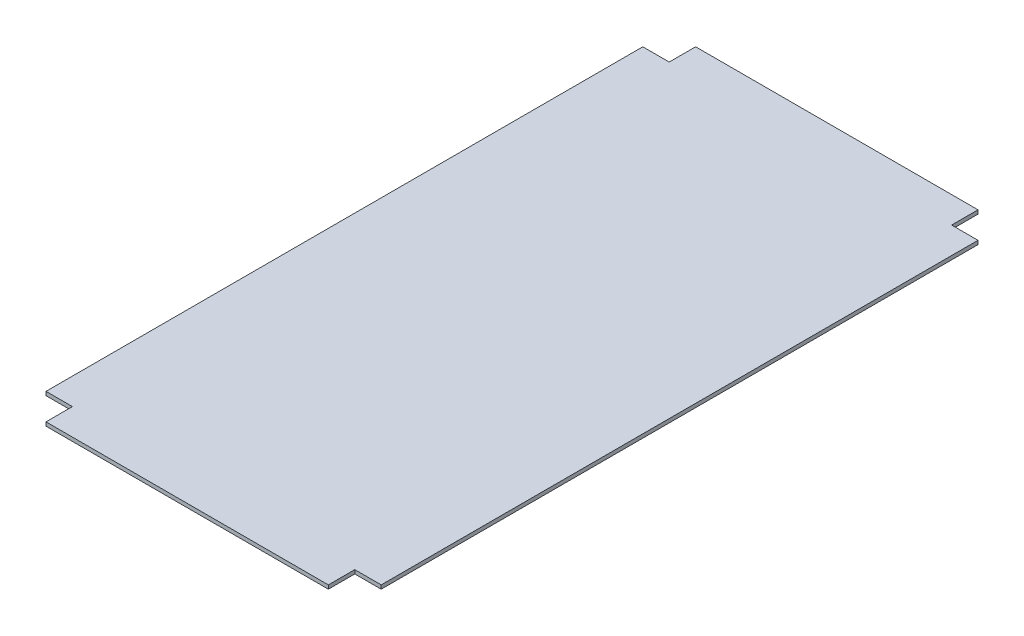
ISO-10303-21;
HEADER;
FILE_DESCRIPTION(('STEP AP214'),'2;1');
FILE_NAME('part.step','',(''),(''),'','','');
FILE_SCHEMA(('AUTOMOTIVE_DESIGN { 1 0 10303 214 1 1 1 1 }'));
ENDSEC;
DATA;
#1=APPLICATION_CONTEXT('core data for automotive mechanical design processes');
#2=APPLICATION_PROTOCOL_DEFINITION('international standard','automotive_design',2000,#1);
#3=PRODUCT_CONTEXT('',#1,'mechanical');
#4=PRODUCT('Part','Part','',(#3));
#5=PRODUCT_RELATED_PRODUCT_CATEGORY('part','',(#4));
#6=PRODUCT_DEFINITION_FORMATION('','',#4);
#7=PRODUCT_DEFINITION_CONTEXT('part definition',#1,'design');
#8=PRODUCT_DEFINITION('design','',#6,#7);
#9=PRODUCT_DEFINITION_SHAPE('','',#8);
#10=(LENGTH_UNIT() NAMED_UNIT(*) SI_UNIT(.MILLI.,.METRE.));
#11=(NAMED_UNIT(*) PLANE_ANGLE_UNIT() SI_UNIT($,.RADIAN.));
#12=(NAMED_UNIT(*) SI_UNIT($,.STERADIAN.) SOLID_ANGLE_UNIT());
#13=UNCERTAINTY_MEASURE_WITH_UNIT(LENGTH_MEASURE(1.E-05),#10,'distance_accuracy_value','');
#14=(GEOMETRIC_REPRESENTATION_CONTEXT(3) GLOBAL_UNCERTAINTY_ASSIGNED_CONTEXT((#13)) GLOBAL_UNIT_ASSIGNED_CONTEXT((#10,
#11,#12)) REPRESENTATION_CONTEXT('',''));
#15=CARTESIAN_POINT('',(0.,0.,0.));
#16=DIRECTION('',(0.,0.,1.));
#17=DIRECTION('',(1.,0.,0.));
#18=AXIS2_PLACEMENT_3D('',#15,#16,#17);
#19=CARTESIAN_POINT('',(-266.5,2.99999999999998,516.5));
#20=DIRECTION('',(1.,0.,0.));
#21=DIRECTION('',(0.,0.,-1.));
#22=AXIS2_PLACEMENT_3D('',#19,#20,#21);
#23=PLANE('',#22);
#24=DIRECTION('',(0.,0.,-1.));
#25=VECTOR('',#24,1.);
#26=CARTESIAN_POINT('',(-266.5,-3.00000000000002,516.5));
#27=LINE('',#26,#25);
#28=CARTESIAN_POINT('',(-266.5,-3.00000000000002,474.5));
#29=VERTEX_POINT('',#28);
#30=CARTESIAN_POINT('',(-266.5,-3.00000000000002,-474.5));
#31=VERTEX_POINT('',#30);
#32=EDGE_CURVE('E11',#29,#31,#27,.T.);
#33=ORIENTED_EDGE('',*,*,#32,.F.);
#34=DIRECTION('',(0.,1.,0.));
#35=VECTOR('',#34,1.);
#36=CARTESIAN_POINT('',(-266.5,-3.00000000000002,474.5));
#37=LINE('',#36,#35);
#38=CARTESIAN_POINT('',(-266.5,2.99999999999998,474.5));
#39=VERTEX_POINT('',#38);
#40=EDGE_CURVE('E174',#29,#39,#37,.T.);
#41=ORIENTED_EDGE('',*,*,#40,.T.);
#42=DIRECTION('',(0.,0.,-1.));
#43=VECTOR('',#42,1.);
#44=CARTESIAN_POINT('',(-266.5,2.99999999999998,516.5));
#45=LINE('',#44,#43);
#46=CARTESIAN_POINT('',(-266.5,2.99999999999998,-474.5));
#47=VERTEX_POINT('',#46);
#48=EDGE_CURVE('E144',#39,#47,#45,.T.);
#49=ORIENTED_EDGE('',*,*,#48,.T.);
#50=DIRECTION('',(0.,1.,0.));
#51=VECTOR('',#50,1.);
#52=CARTESIAN_POINT('',(-266.5,-3.00000000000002,-474.5));
#53=LINE('',#52,#51);
#54=EDGE_CURVE('E159',#31,#47,#53,.T.);
#55=ORIENTED_EDGE('',*,*,#54,.F.);
#56=EDGE_LOOP('',(#33,#41,#49,#55));
#57=FACE_BOUND('',#56,.T.);
#58=ADVANCED_FACE('F34',(#57),#23,.F.);
#59=CARTESIAN_POINT('',(-266.5,-3.00000000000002,516.5));
#60=DIRECTION('',(0.,1.,0.));
#61=DIRECTION('',(0.,0.,1.));
#62=AXIS2_PLACEMENT_3D('',#59,#60,#61);
#63=PLANE('',#62);
#64=DIRECTION('',(-1.,0.,0.));
#65=VECTOR('',#64,1.);
#66=CARTESIAN_POINT('',(266.5,-3.00000000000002,474.5));
#67=LINE('',#66,#65);
#68=CARTESIAN_POINT('',(266.5,-3.00000000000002,474.5));
#69=VERTEX_POINT('',#68);
#70=CARTESIAN_POINT('',(224.5,-3.00000000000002,474.5));
#71=VERTEX_POINT('',#70);
#72=EDGE_CURVE('E120',#69,#71,#67,.T.);
#73=ORIENTED_EDGE('',*,*,#72,.T.);
#74=DIRECTION('',(0.,0.,1.));
#75=VECTOR('',#74,1.);
#76=CARTESIAN_POINT('',(224.5,-3.00000000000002,516.5));
#77=LINE('',#76,#75);
#78=CARTESIAN_POINT('',(224.5,-3.00000000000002,516.5));
#79=VERTEX_POINT('',#78);
#80=EDGE_CURVE('E131',#71,#79,#77,.T.);
#81=ORIENTED_EDGE('',*,*,#80,.T.);
#82=DIRECTION('',(1.,0.,0.));
#83=VECTOR('',#82,1.);
#84=CARTESIAN_POINT('',(-266.5,-3.00000000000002,516.5));
#85=LINE('',#84,#83);
#86=CARTESIAN_POINT('',(-224.5,-3.00000000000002,516.5));
#87=VERTEX_POINT('',#86);
#88=EDGE_CURVE('E151',#87,#79,#85,.T.);
#89=ORIENTED_EDGE('',*,*,#88,.F.);
#90=DIRECTION('',(0.,0.,-1.));
#91=VECTOR('',#90,1.);
#92=CARTESIAN_POINT('',(-224.5,-3.00000000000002,516.5));
#93=LINE('',#92,#91);
#94=CARTESIAN_POINT('',(-224.5,-3.00000000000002,474.5));
#95=VERTEX_POINT('',#94);
#96=EDGE_CURVE('E189',#87,#95,#93,.T.);
#97=ORIENTED_EDGE('',*,*,#96,.T.);
#98=DIRECTION('',(-1.,0.,0.));
#99=VECTOR('',#98,1.);
#100=CARTESIAN_POINT('',(-266.5,-3.00000000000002,474.5));
#101=LINE('',#100,#99);
#102=EDGE_CURVE('E183',#95,#29,#101,.T.);
#103=ORIENTED_EDGE('',*,*,#102,.T.);
#104=ORIENTED_EDGE('',*,*,#32,.T.);
#105=DIRECTION('',(1.,0.,0.));
#106=VECTOR('',#105,1.);
#107=CARTESIAN_POINT('',(-266.5,-3.00000000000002,-474.5));
#108=LINE('',#107,#106);
#109=CARTESIAN_POINT('',(-224.5,-3.00000000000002,-474.5));
#110=VERTEX_POINT('',#109);
#111=EDGE_CURVE('E170',#31,#110,#108,.T.);
#112=ORIENTED_EDGE('',*,*,#111,.T.);
#113=DIRECTION('',(0.,0.,-1.));
#114=VECTOR('',#113,1.);
#115=CARTESIAN_POINT('',(-224.5,-3.00000000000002,-516.5));
#116=LINE('',#115,#114);
#117=CARTESIAN_POINT('',(-224.5,-3.00000000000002,-516.5));
#118=VERTEX_POINT('',#117);
#119=EDGE_CURVE('E163',#110,#118,#116,.T.);
#120=ORIENTED_EDGE('',*,*,#119,.T.);
#121=DIRECTION('',(1.,0.,0.));
#122=VECTOR('',#121,1.);
#123=CARTESIAN_POINT('',(-266.5,-3.00000000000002,-516.5));
#124=LINE('',#123,#122);
#125=CARTESIAN_POINT('',(224.5,-3.00000000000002,-516.5));
#126=VERTEX_POINT('',#125);
#127=EDGE_CURVE('E152',#118,#126,#124,.T.);
#128=ORIENTED_EDGE('',*,*,#127,.T.);
#129=DIRECTION('',(0.,0.,1.));
#130=VECTOR('',#129,1.);
#131=CARTESIAN_POINT('',(224.5,-3.00000000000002,-516.5));
#132=LINE('',#131,#130);
#133=CARTESIAN_POINT('',(224.5,-3.00000000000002,-474.5));
#134=VERTEX_POINT('',#133);
#135=EDGE_CURVE('E56',#126,#134,#132,.T.);
#136=ORIENTED_EDGE('',*,*,#135,.T.);
#137=DIRECTION('',(1.,0.,0.));
#138=VECTOR('',#137,1.);
#139=CARTESIAN_POINT('',(266.5,-3.00000000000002,-474.5));
#140=LINE('',#139,#138);
#141=CARTESIAN_POINT('',(266.5,-3.00000000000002,-474.5));
#142=VERTEX_POINT('',#141);
#143=EDGE_CURVE('E143',#134,#142,#140,.T.);
#144=ORIENTED_EDGE('',*,*,#143,.T.);
#145=DIRECTION('',(0.,0.,-1.));
#146=VECTOR('',#145,1.);
#147=CARTESIAN_POINT('',(266.5,-3.00000000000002,516.5));
#148=LINE('',#147,#146);
#149=EDGE_CURVE('E41',#69,#142,#148,.T.);
#150=ORIENTED_EDGE('',*,*,#149,.F.);
#151=EDGE_LOOP('',(#73,#81,#89,#97,#103,#104,#112,#120,#128,#136,#144,#150));
#152=FACE_BOUND('',#151,.T.);
#153=ADVANCED_FACE('F141',(#152),#63,.F.);
#154=CARTESIAN_POINT('',(266.5,2.99999999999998,516.5));
#155=DIRECTION('',(-1.,0.,0.));
#156=DIRECTION('',(0.,0.,1.));
#157=AXIS2_PLACEMENT_3D('',#154,#155,#156);
#158=PLANE('',#157);
#159=DIRECTION('',(0.,0.,-1.));
#160=VECTOR('',#159,1.);
#161=CARTESIAN_POINT('',(266.5,2.99999999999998,516.5));
#162=LINE('',#161,#160);
#163=CARTESIAN_POINT('',(266.5,2.99999999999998,474.5));
#164=VERTEX_POINT('',#163);
#165=CARTESIAN_POINT('',(266.5,2.99999999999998,-474.5));
#166=VERTEX_POINT('',#165);
#167=EDGE_CURVE('E138',#164,#166,#162,.T.);
#168=ORIENTED_EDGE('',*,*,#167,.F.);
#169=DIRECTION('',(0.,1.,0.));
#170=VECTOR('',#169,1.);
#171=CARTESIAN_POINT('',(266.5,-3.00000000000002,474.5));
#172=LINE('',#171,#170);
#173=EDGE_CURVE('E124',#69,#164,#172,.T.);
#174=ORIENTED_EDGE('',*,*,#173,.F.);
#175=ORIENTED_EDGE('',*,*,#149,.T.);
#176=DIRECTION('',(0.,1.,0.));
#177=VECTOR('',#176,1.);
#178=CARTESIAN_POINT('',(266.5,-3.00000000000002,-474.5));
#179=LINE('',#178,#177);
#180=EDGE_CURVE('E193',#142,#166,#179,.T.);
#181=ORIENTED_EDGE('',*,*,#180,.T.);
#182=EDGE_LOOP('',(#168,#174,#175,#181));
#183=FACE_BOUND('',#182,.T.);
#184=ADVANCED_FACE('F135',(#183),#158,.F.);
#185=CARTESIAN_POINT('',(-266.5,2.99999999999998,516.5));
#186=DIRECTION('',(0.,-1.,0.));
#187=DIRECTION('',(0.,0.,-1.));
#188=AXIS2_PLACEMENT_3D('',#185,#186,#187);
#189=PLANE('',#188);
#190=DIRECTION('',(-1.,0.,0.));
#191=VECTOR('',#190,1.);
#192=CARTESIAN_POINT('',(-266.5,2.99999999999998,516.5));
#193=LINE('',#192,#191);
#194=CARTESIAN_POINT('',(224.5,2.99999999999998,516.5));
#195=VERTEX_POINT('',#194);
#196=CARTESIAN_POINT('',(-224.5,2.99999999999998,516.5));
#197=VERTEX_POINT('',#196);
#198=EDGE_CURVE('E148',#195,#197,#193,.T.);
#199=ORIENTED_EDGE('',*,*,#198,.F.);
#200=DIRECTION('',(0.,0.,1.));
#201=VECTOR('',#200,1.);
#202=CARTESIAN_POINT('',(224.5,2.99999999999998,516.5));
#203=LINE('',#202,#201);
#204=CARTESIAN_POINT('',(224.5,2.99999999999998,474.5));
#205=VERTEX_POINT('',#204);
#206=EDGE_CURVE('E48',#205,#195,#203,.T.);
#207=ORIENTED_EDGE('',*,*,#206,.F.);
#208=DIRECTION('',(-1.,0.,0.));
#209=VECTOR('',#208,1.);
#210=CARTESIAN_POINT('',(266.5,2.99999999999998,474.5));
#211=LINE('',#210,#209);
#212=EDGE_CURVE('E215',#164,#205,#211,.T.);
#213=ORIENTED_EDGE('',*,*,#212,.F.);
#214=ORIENTED_EDGE('',*,*,#167,.T.);
#215=DIRECTION('',(1.,0.,0.));
#216=VECTOR('',#215,1.);
#217=CARTESIAN_POINT('',(266.5,2.99999999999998,-474.5));
#218=LINE('',#217,#216);
#219=CARTESIAN_POINT('',(224.5,2.99999999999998,-474.5));
#220=VERTEX_POINT('',#219);
#221=EDGE_CURVE('E203',#220,#166,#218,.T.);
#222=ORIENTED_EDGE('',*,*,#221,.F.);
#223=DIRECTION('',(0.,0.,1.));
#224=VECTOR('',#223,1.);
#225=CARTESIAN_POINT('',(224.5,2.99999999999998,-516.5));
#226=LINE('',#225,#224);
#227=CARTESIAN_POINT('',(224.5,2.99999999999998,-516.5));
#228=VERTEX_POINT('',#227);
#229=EDGE_CURVE('E206',#228,#220,#226,.T.);
#230=ORIENTED_EDGE('',*,*,#229,.F.);
#231=DIRECTION('',(-1.,0.,0.));
#232=VECTOR('',#231,1.);
#233=CARTESIAN_POINT('',(-266.5,2.99999999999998,-516.5));
#234=LINE('',#233,#232);
#235=CARTESIAN_POINT('',(-224.5,2.99999999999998,-516.5));
#236=VERTEX_POINT('',#235);
#237=EDGE_CURVE('E149',#228,#236,#234,.T.);
#238=ORIENTED_EDGE('',*,*,#237,.T.);
#239=DIRECTION('',(0.,0.,-1.));
#240=VECTOR('',#239,1.);
#241=CARTESIAN_POINT('',(-224.5,2.99999999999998,-516.5));
#242=LINE('',#241,#240);
#243=CARTESIAN_POINT('',(-224.5,2.99999999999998,-474.5));
#244=VERTEX_POINT('',#243);
#245=EDGE_CURVE('E167',#244,#236,#242,.T.);
#246=ORIENTED_EDGE('',*,*,#245,.F.);
#247=DIRECTION('',(1.,0.,0.));
#248=VECTOR('',#247,1.);
#249=CARTESIAN_POINT('',(-266.5,2.99999999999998,-474.5));
#250=LINE('',#249,#248);
#251=EDGE_CURVE('E171',#47,#244,#250,.T.);
#252=ORIENTED_EDGE('',*,*,#251,.F.);
#253=ORIENTED_EDGE('',*,*,#48,.F.);
#254=DIRECTION('',(-1.,0.,0.));
#255=VECTOR('',#254,1.);
#256=CARTESIAN_POINT('',(-266.5,2.99999999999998,474.5));
#257=LINE('',#256,#255);
#258=CARTESIAN_POINT('',(-224.5,2.99999999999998,474.5));
#259=VERTEX_POINT('',#258);
#260=EDGE_CURVE('E187',#259,#39,#257,.T.);
#261=ORIENTED_EDGE('',*,*,#260,.F.);
#262=DIRECTION('',(0.,0.,-1.));
#263=VECTOR('',#262,1.);
#264=CARTESIAN_POINT('',(-224.5,2.99999999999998,516.5));
#265=LINE('',#264,#263);
#266=EDGE_CURVE('E190',#197,#259,#265,.T.);
#267=ORIENTED_EDGE('',*,*,#266,.F.);
#268=EDGE_LOOP('',(#199,#207,#213,#214,#222,#230,#238,#246,#252,#253,#261,#267));
#269=FACE_BOUND('',#268,.T.);
#270=ADVANCED_FACE('F227',(#269),#189,.F.);
#271=CARTESIAN_POINT('',(-266.5,-3.00000000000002,516.5));
#272=DIRECTION('',(0.,0.,1.));
#273=DIRECTION('',(1.,0.,0.));
#274=AXIS2_PLACEMENT_3D('',#271,#272,#273);
#275=PLANE('',#274);
#276=DIRECTION('',(0.,1.,0.));
#277=VECTOR('',#276,1.);
#278=CARTESIAN_POINT('',(224.5,-3.00000000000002,516.5));
#279=LINE('',#278,#277);
#280=EDGE_CURVE('E209',#79,#195,#279,.T.);
#281=ORIENTED_EDGE('',*,*,#280,.T.);
#282=ORIENTED_EDGE('',*,*,#198,.T.);
#283=DIRECTION('',(0.,1.,0.));
#284=VECTOR('',#283,1.);
#285=CARTESIAN_POINT('',(-224.5,-3.00000000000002,516.5));
#286=LINE('',#285,#284);
#287=EDGE_CURVE('E179',#87,#197,#286,.T.);
#288=ORIENTED_EDGE('',*,*,#287,.F.);
#289=ORIENTED_EDGE('',*,*,#88,.T.);
#290=EDGE_LOOP('',(#281,#282,#288,#289));
#291=FACE_BOUND('',#290,.T.);
#292=ADVANCED_FACE('F220',(#291),#275,.T.);
#293=CARTESIAN_POINT('',(-266.5,-3.00000000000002,-516.5));
#294=DIRECTION('',(0.,0.,1.));
#295=DIRECTION('',(1.,0.,0.));
#296=AXIS2_PLACEMENT_3D('',#293,#294,#295);
#297=PLANE('',#296);
#298=ORIENTED_EDGE('',*,*,#237,.F.);
#299=DIRECTION('',(0.,1.,0.));
#300=VECTOR('',#299,1.);
#301=CARTESIAN_POINT('',(224.5,-3.00000000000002,-516.5));
#302=LINE('',#301,#300);
#303=EDGE_CURVE('E198',#126,#228,#302,.T.);
#304=ORIENTED_EDGE('',*,*,#303,.F.);
#305=ORIENTED_EDGE('',*,*,#127,.F.);
#306=DIRECTION('',(0.,1.,0.));
#307=VECTOR('',#306,1.);
#308=CARTESIAN_POINT('',(-224.5,-3.00000000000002,-516.5));
#309=LINE('',#308,#307);
#310=EDGE_CURVE('E155',#118,#236,#309,.T.);
#311=ORIENTED_EDGE('',*,*,#310,.T.);
#312=EDGE_LOOP('',(#298,#304,#305,#311));
#313=FACE_BOUND('',#312,.T.);
#314=ADVANCED_FACE('F246',(#313),#297,.F.);
#315=CARTESIAN_POINT('',(-224.5,-3.00000000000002,-516.5));
#316=DIRECTION('',(1.,0.,0.));
#317=DIRECTION('',(0.,0.,-1.));
#318=AXIS2_PLACEMENT_3D('',#315,#316,#317);
#319=PLANE('',#318);
#320=ORIENTED_EDGE('',*,*,#245,.T.);
#321=ORIENTED_EDGE('',*,*,#310,.F.);
#322=ORIENTED_EDGE('',*,*,#119,.F.);
#323=DIRECTION('',(0.,1.,0.));
#324=VECTOR('',#323,1.);
#325=CARTESIAN_POINT('',(-224.5,-3.00000000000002,-474.5));
#326=LINE('',#325,#324);
#327=EDGE_CURVE('E162',#110,#244,#326,.T.);
#328=ORIENTED_EDGE('',*,*,#327,.T.);
#329=EDGE_LOOP('',(#320,#321,#322,#328));
#330=FACE_BOUND('',#329,.T.);
#331=ADVANCED_FACE('F242',(#330),#319,.F.);
#332=CARTESIAN_POINT('',(-266.5,-3.00000000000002,-474.5));
#333=DIRECTION('',(0.,0.,1.));
#334=DIRECTION('',(1.,0.,0.));
#335=AXIS2_PLACEMENT_3D('',#332,#333,#334);
#336=PLANE('',#335);
#337=ORIENTED_EDGE('',*,*,#251,.T.);
#338=ORIENTED_EDGE('',*,*,#327,.F.);
#339=ORIENTED_EDGE('',*,*,#111,.F.);
#340=ORIENTED_EDGE('',*,*,#54,.T.);
#341=EDGE_LOOP('',(#337,#338,#339,#340));
#342=FACE_BOUND('',#341,.T.);
#343=ADVANCED_FACE('F238',(#342),#336,.F.);
#344=CARTESIAN_POINT('',(-266.5,-3.00000000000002,474.5));
#345=DIRECTION('',(0.,0.,-1.));
#346=DIRECTION('',(-1.,0.,0.));
#347=AXIS2_PLACEMENT_3D('',#344,#345,#346);
#348=PLANE('',#347);
#349=ORIENTED_EDGE('',*,*,#260,.T.);
#350=ORIENTED_EDGE('',*,*,#40,.F.);
#351=ORIENTED_EDGE('',*,*,#102,.F.);
#352=DIRECTION('',(0.,1.,0.));
#353=VECTOR('',#352,1.);
#354=CARTESIAN_POINT('',(-224.5,-3.00000000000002,474.5));
#355=LINE('',#354,#353);
#356=EDGE_CURVE('E182',#95,#259,#355,.T.);
#357=ORIENTED_EDGE('',*,*,#356,.T.);
#358=EDGE_LOOP('',(#349,#350,#351,#357));
#359=FACE_BOUND('',#358,.T.);
#360=ADVANCED_FACE('F231',(#359),#348,.F.);
#361=CARTESIAN_POINT('',(-224.5,-3.00000000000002,516.5));
#362=DIRECTION('',(1.,0.,0.));
#363=DIRECTION('',(0.,0.,-1.));
#364=AXIS2_PLACEMENT_3D('',#361,#362,#363);
#365=PLANE('',#364);
#366=ORIENTED_EDGE('',*,*,#266,.T.);
#367=ORIENTED_EDGE('',*,*,#356,.F.);
#368=ORIENTED_EDGE('',*,*,#96,.F.);
#369=ORIENTED_EDGE('',*,*,#287,.T.);
#370=EDGE_LOOP('',(#366,#367,#368,#369));
#371=FACE_BOUND('',#370,.T.);
#372=ADVANCED_FACE('F224',(#371),#365,.F.);
#373=CARTESIAN_POINT('',(266.5,-3.00000000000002,-474.5));
#374=DIRECTION('',(0.,0.,1.));
#375=DIRECTION('',(1.,0.,0.));
#376=AXIS2_PLACEMENT_3D('',#373,#374,#375);
#377=PLANE('',#376);
#378=ORIENTED_EDGE('',*,*,#221,.T.);
#379=ORIENTED_EDGE('',*,*,#180,.F.);
#380=ORIENTED_EDGE('',*,*,#143,.F.);
#381=DIRECTION('',(0.,1.,0.));
#382=VECTOR('',#381,1.);
#383=CARTESIAN_POINT('',(224.5,-3.00000000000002,-474.5));
#384=LINE('',#383,#382);
#385=EDGE_CURVE('E200',#134,#220,#384,.T.);
#386=ORIENTED_EDGE('',*,*,#385,.T.);
#387=EDGE_LOOP('',(#378,#379,#380,#386));
#388=FACE_BOUND('',#387,.T.);
#389=ADVANCED_FACE('F251',(#388),#377,.F.);
#390=CARTESIAN_POINT('',(224.5,-3.00000000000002,-516.5));
#391=DIRECTION('',(-1.,0.,0.));
#392=DIRECTION('',(0.,0.,1.));
#393=AXIS2_PLACEMENT_3D('',#390,#391,#392);
#394=PLANE('',#393);
#395=ORIENTED_EDGE('',*,*,#229,.T.);
#396=ORIENTED_EDGE('',*,*,#385,.F.);
#397=ORIENTED_EDGE('',*,*,#135,.F.);
#398=ORIENTED_EDGE('',*,*,#303,.T.);
#399=EDGE_LOOP('',(#395,#396,#397,#398));
#400=FACE_BOUND('',#399,.T.);
#401=ADVANCED_FACE('F248',(#400),#394,.F.);
#402=CARTESIAN_POINT('',(224.5,-3.00000000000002,516.5));
#403=DIRECTION('',(-1.,0.,0.));
#404=DIRECTION('',(0.,0.,1.));
#405=AXIS2_PLACEMENT_3D('',#402,#403,#404);
#406=PLANE('',#405);
#407=ORIENTED_EDGE('',*,*,#206,.T.);
#408=ORIENTED_EDGE('',*,*,#280,.F.);
#409=ORIENTED_EDGE('',*,*,#80,.F.);
#410=DIRECTION('',(0.,1.,0.));
#411=VECTOR('',#410,1.);
#412=CARTESIAN_POINT('',(224.5,-3.00000000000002,474.5));
#413=LINE('',#412,#411);
#414=EDGE_CURVE('E126',#71,#205,#413,.T.);
#415=ORIENTED_EDGE('',*,*,#414,.T.);
#416=EDGE_LOOP('',(#407,#408,#409,#415));
#417=FACE_BOUND('',#416,.T.);
#418=ADVANCED_FACE('F258',(#417),#406,.F.);
#419=CARTESIAN_POINT('',(266.5,-3.00000000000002,474.5));
#420=DIRECTION('',(0.,0.,-1.));
#421=DIRECTION('',(-1.,0.,0.));
#422=AXIS2_PLACEMENT_3D('',#419,#420,#421);
#423=PLANE('',#422);
#424=ORIENTED_EDGE('',*,*,#212,.T.);
#425=ORIENTED_EDGE('',*,*,#414,.F.);
#426=ORIENTED_EDGE('',*,*,#72,.F.);
#427=ORIENTED_EDGE('',*,*,#173,.T.);
#428=EDGE_LOOP('',(#424,#425,#426,#427));
#429=FACE_BOUND('',#428,.T.);
#430=ADVANCED_FACE('F123',(#429),#423,.F.);
#431=CLOSED_SHELL('',(#58,#153,#184,#270,#292,#314,#331,#343,#360,#372,#389,#401,#418,#430));
#432=MANIFOLD_SOLID_BREP('B2',#431);
#433=ADVANCED_BREP_SHAPE_REPRESENTATION('',(#18,#432),#14);
#434=SHAPE_DEFINITION_REPRESENTATION(#9,#433);
ENDSEC;
END-ISO-10303-21;
